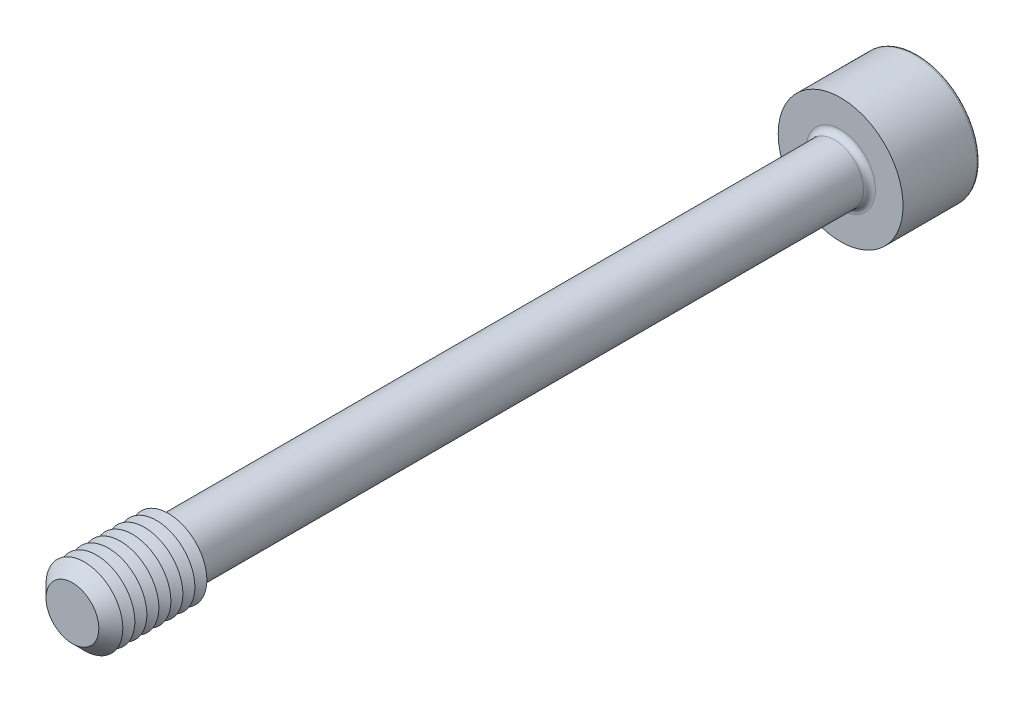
from build123d import *

# Parameters (mm, degrees)
SKETCH1_R       = 3
EXTRUDE1_DEPTH  = 40
CHAMFER1_SIZE   = 1.25
SKETCH3_R       = 6.5
EXTRUDE2_DEPTH  = 8
EXTRUDE3_DEPTH  = 6
FILLET1_R       = 0.62
FILLET2_R       = 0.31
LPATTERN1_COUNT = 7
LPATTERN1_PITCH = 1.25


with BuildPart() as part:
    # Sketch1 → Extrude1 (new, symmetric)
    with BuildSketch(Plane.XY):
        Circle(SKETCH1_R)
    extrude(amount=EXTRUDE1_DEPTH, both=True)

    # Sketch2 → Revolve1 (revolve)
    with BuildSketch(Plane(origin=(0, 0, 0), x_dir=(0, 0, -1), z_dir=(1, 0, 0))):
        Polygon((-40, 0), (-40, 4), (-30, 4), (-29.422649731, 3), (-29.422649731, 0), align=None)
    revolve(axis=Axis((0, 0, 29.422649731), (0, 0, 1)))

    # Chamfer1
    chamfer1_edges = [part.edges().sort_by_distance(p)[0] for p in [
        (0, -4, 40),
    ]]
    chamfer(chamfer1_edges, length=CHAMFER1_SIZE)

    # Sketch3 → Extrude2 (add)
    with BuildSketch(Plane(origin=(0, 0, -40), x_dir=(-1, 0, 0), z_dir=(0, 0, -1))):
        Circle(SKETCH3_R)
    extrude(amount=EXTRUDE2_DEPTH)

    # Sketch4 → Extrude3 (cut)
    with BuildSketch(Plane(origin=(-13.7, 0, -48), x_dir=(1, 0, 0), z_dir=(0, 0, 1))):
        Polygon((11.967949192, -3), (15.432050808, -3), (17.164101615, 0), (15.432050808, 3), (11.967949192, 3), (10.235898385, 0), align=None)
    extrude(amount=EXTRUDE3_DEPTH, mode=Mode.SUBTRACT)

    # Fillet1
    fillet1_edges = [part.edges().sort_by_distance(p)[0] for p in [
        (-3, 0, -40),
    ]]
    fillet(fillet1_edges, radius=FILLET1_R)

    # Fillet2
    fillet2_edges = [part.edges().sort_by_distance(p)[0] for p in [
        (6.5, 0, -48),
    ]]
    fillet(fillet2_edges, radius=FILLET2_R)

    # Sketch5 → Cut-Revolve1 (revolve, cut)
    with BuildSketch(Plane(origin=(0, 0, 0), x_dir=(0, 0, -1), z_dir=(1, 0, 0)), mode=Mode.PRIVATE) as cut_revolve1_sk:
        Polygon((42, 0), (42, -3), (40.267949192, 0), align=None)
    revolve(cut_revolve1_sk.sketch.rotate(Axis((0, 0, -40.267949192), (0, 0, -1)), 90), axis=Axis((0, 0, -40.267949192), (0, 0, -1)), mode=Mode.SUBTRACT)

    # Sketch7 → Cut-Revolve2 (revolve, cut)
    with BuildSketch(Plane(origin=(0, 0, 0), x_dir=(0, 0, -1), z_dir=(1, 0, 0)), mode=Mode.PRIVATE) as cut_revolve2_sk:
        Polygon((-30, 4), (-30.625, 2.917468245), (-31.25, 4), align=None)
    cut_revolve2 = revolve(cut_revolve2_sk.sketch.rotate(Axis((0, 0, -1.332048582), (0, 0, 1)), 90), axis=Axis((0, 0, -1.332048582), (0, 0, 1)), mode=Mode.SUBTRACT)

    # LPattern1: Cut-Revolve2 ×7
    with Locations(*[(0, 0, i * LPATTERN1_PITCH) for i in range(1, LPATTERN1_COUNT)]):
        add(cut_revolve2, mode=Mode.SUBTRACT)


solid = part.part
